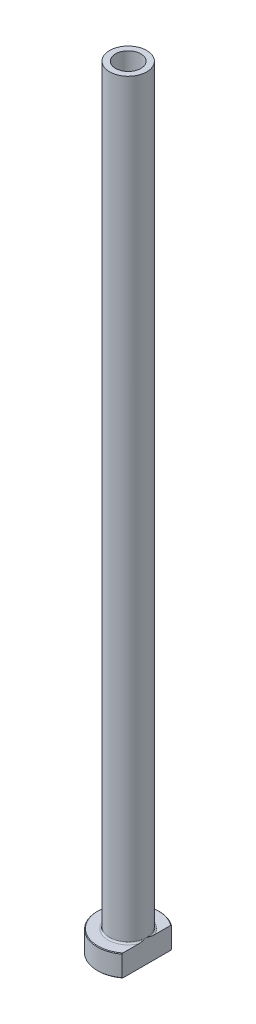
ISO-10303-21;
HEADER;
FILE_DESCRIPTION(('STEP AP214'),'2;1');
FILE_NAME('part.step','',(''),(''),'','','');
FILE_SCHEMA(('AUTOMOTIVE_DESIGN { 1 0 10303 214 1 1 1 1 }'));
ENDSEC;
DATA;
#1=APPLICATION_CONTEXT('core data for automotive mechanical design processes');
#2=APPLICATION_PROTOCOL_DEFINITION('international standard','automotive_design',2000,#1);
#3=PRODUCT_CONTEXT('',#1,'mechanical');
#4=PRODUCT('Part','Part','',(#3));
#5=PRODUCT_RELATED_PRODUCT_CATEGORY('part','',(#4));
#6=PRODUCT_DEFINITION_FORMATION('','',#4);
#7=PRODUCT_DEFINITION_CONTEXT('part definition',#1,'design');
#8=PRODUCT_DEFINITION('design','',#6,#7);
#9=PRODUCT_DEFINITION_SHAPE('','',#8);
#10=(LENGTH_UNIT() NAMED_UNIT(*) SI_UNIT(.MILLI.,.METRE.));
#11=(NAMED_UNIT(*) PLANE_ANGLE_UNIT() SI_UNIT($,.RADIAN.));
#12=(NAMED_UNIT(*) SI_UNIT($,.STERADIAN.) SOLID_ANGLE_UNIT());
#13=UNCERTAINTY_MEASURE_WITH_UNIT(LENGTH_MEASURE(1.E-05),#10,'distance_accuracy_value','');
#14=(GEOMETRIC_REPRESENTATION_CONTEXT(3) GLOBAL_UNCERTAINTY_ASSIGNED_CONTEXT((#13)) GLOBAL_UNIT_ASSIGNED_CONTEXT((#10,
#11,#12)) REPRESENTATION_CONTEXT('',''));
#15=CARTESIAN_POINT('',(0.,0.,0.));
#16=DIRECTION('',(0.,0.,1.));
#17=DIRECTION('',(1.,0.,0.));
#18=AXIS2_PLACEMENT_3D('',#15,#16,#17);
#19=CARTESIAN_POINT('',(0.,92.1876809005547,0.));
#20=DIRECTION('',(0.,1.,0.));
#21=DIRECTION('',(0.,0.,1.));
#22=AXIS2_PLACEMENT_3D('',#19,#20,#21);
#23=CYLINDRICAL_SURFACE('',#22,4.10000000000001);
#24=CARTESIAN_POINT('',(0.,250.,0.));
#25=DIRECTION('',(0.,1.,0.));
#26=DIRECTION('',(0.,0.,1.));
#27=AXIS2_PLACEMENT_3D('',#24,#25,#26);
#28=CIRCLE('',#27,4.10000000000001);
#29=CARTESIAN_POINT('',(0.,250.,4.10000000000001));
#30=VERTEX_POINT('',#29);
#31=EDGE_CURVE('E167',#30,#30,#28,.T.);
#32=ORIENTED_EDGE('',*,*,#31,.T.);
#33=EDGE_LOOP('',(#32));
#34=FACE_BOUND('',#33,.T.);
#35=CARTESIAN_POINT('',(0.,205.,0.));
#36=DIRECTION('',(0.,1.,0.));
#37=DIRECTION('',(0.,0.,1.));
#38=AXIS2_PLACEMENT_3D('',#35,#36,#37);
#39=CIRCLE('',#38,4.10000000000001);
#40=CARTESIAN_POINT('',(0.,205.,4.10000000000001));
#41=VERTEX_POINT('',#40);
#42=EDGE_CURVE('E170',#41,#41,#39,.T.);
#43=ORIENTED_EDGE('',*,*,#42,.F.);
#44=EDGE_LOOP('',(#43));
#45=FACE_BOUND('',#44,.T.);
#46=ADVANCED_FACE('F32',(#34,#45),#23,.F.);
#47=CARTESIAN_POINT('',(-4.10000000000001,250.,0.));
#48=DIRECTION('',(0.,1.,0.));
#49=DIRECTION('',(0.,0.,1.));
#50=AXIS2_PLACEMENT_3D('',#47,#48,#49);
#51=PLANE('',#50);
#52=CARTESIAN_POINT('',(0.,250.,0.));
#53=DIRECTION('',(0.,1.,0.));
#54=DIRECTION('',(0.,0.,1.));
#55=AXIS2_PLACEMENT_3D('',#52,#53,#54);
#56=CIRCLE('',#55,6.00000000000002);
#57=CARTESIAN_POINT('',(0.,250.,6.00000000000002));
#58=VERTEX_POINT('',#57);
#59=EDGE_CURVE('E174',#58,#58,#56,.T.);
#60=ORIENTED_EDGE('',*,*,#59,.T.);
#61=EDGE_LOOP('',(#60));
#62=FACE_BOUND('',#61,.T.);
#63=ORIENTED_EDGE('',*,*,#31,.F.);
#64=EDGE_LOOP('',(#63));
#65=FACE_BOUND('',#64,.T.);
#66=ADVANCED_FACE('F157',(#62,#65),#51,.T.);
#67=CARTESIAN_POINT('',(0.,92.1876809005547,0.));
#68=DIRECTION('',(0.,1.,0.));
#69=DIRECTION('',(0.,0.,1.));
#70=AXIS2_PLACEMENT_3D('',#67,#68,#69);
#71=CYLINDRICAL_SURFACE('',#70,6.);
#72=CARTESIAN_POINT('',(0.,7.50000000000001,0.));
#73=DIRECTION('',(0.,1.,0.));
#74=DIRECTION('',(0.,0.,1.));
#75=AXIS2_PLACEMENT_3D('',#72,#73,#74);
#76=CIRCLE('',#75,6.);
#77=CARTESIAN_POINT('',(6.,7.50000000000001,0.));
#78=VERTEX_POINT('',#77);
#79=EDGE_CURVE('E180',#78,#78,#76,.T.);
#80=ORIENTED_EDGE('',*,*,#79,.T.);
#81=EDGE_LOOP('',(#80));
#82=FACE_BOUND('',#81,.T.);
#83=ORIENTED_EDGE('',*,*,#59,.F.);
#84=EDGE_LOOP('',(#83));
#85=FACE_BOUND('',#84,.T.);
#86=ADVANCED_FACE('F162',(#82,#85),#71,.T.);
#87=CARTESIAN_POINT('',(-5.99999999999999,7.,0.));
#88=DIRECTION('',(0.,1.,0.));
#89=DIRECTION('',(0.,0.,1.));
#90=AXIS2_PLACEMENT_3D('',#87,#88,#89);
#91=PLANE('',#90);
#92=DIRECTION('',(0.,0.,1.));
#93=VECTOR('',#92,1.);
#94=CARTESIAN_POINT('',(6.,7.,0.));
#95=LINE('',#94,#93);
#96=CARTESIAN_POINT('',(6.,7.,-7.74854825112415));
#97=VERTEX_POINT('',#96);
#98=CARTESIAN_POINT('',(6.,7.,-2.50000000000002));
#99=VERTEX_POINT('',#98);
#100=EDGE_CURVE('E54',#97,#99,#95,.T.);
#101=ORIENTED_EDGE('',*,*,#100,.F.);
#102=CARTESIAN_POINT('',(0.,7.,0.));
#103=DIRECTION('',(0.,1.,0.));
#104=DIRECTION('',(0.,0.,1.));
#105=AXIS2_PLACEMENT_3D('',#102,#103,#104);
#106=CIRCLE('',#105,9.79999999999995);
#107=CARTESIAN_POINT('',(5.99999999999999,7.,7.74854825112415));
#108=VERTEX_POINT('',#107);
#109=EDGE_CURVE('E186',#97,#108,#106,.T.);
#110=ORIENTED_EDGE('',*,*,#109,.T.);
#111=CARTESIAN_POINT('',(6.,7.,2.50000000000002));
#112=VERTEX_POINT('',#111);
#113=EDGE_CURVE('E134',#112,#108,#95,.T.);
#114=ORIENTED_EDGE('',*,*,#113,.F.);
#115=CARTESIAN_POINT('',(0.,7.,0.));
#116=DIRECTION('',(0.,1.,0.));
#117=DIRECTION('',(0.,0.,1.));
#118=AXIS2_PLACEMENT_3D('',#115,#116,#117);
#119=CIRCLE('',#118,6.5);
#120=EDGE_CURVE('E183',#112,#99,#119,.F.);
#121=ORIENTED_EDGE('',*,*,#120,.T.);
#122=EDGE_LOOP('',(#101,#110,#114,#121));
#123=FACE_BOUND('',#122,.T.);
#124=ADVANCED_FACE('F197',(#123),#91,.T.);
#125=CARTESIAN_POINT('',(0.,92.1876809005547,0.));
#126=DIRECTION('',(0.,1.,0.));
#127=DIRECTION('',(0.,0.,1.));
#128=AXIS2_PLACEMENT_3D('',#125,#126,#127);
#129=CYLINDRICAL_SURFACE('',#128,9.99999999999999);
#130=DIRECTION('',(0.,-1.,0.));
#131=VECTOR('',#130,1.);
#132=CARTESIAN_POINT('',(5.99999999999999,250.,7.99999999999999));
#133=LINE('',#132,#131);
#134=CARTESIAN_POINT('',(5.99999999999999,6.8,7.99999999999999));
#135=VERTEX_POINT('',#134);
#136=CARTESIAN_POINT('',(5.99999999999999,0.200000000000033,7.99999999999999));
#137=VERTEX_POINT('',#136);
#138=EDGE_CURVE('E82',#135,#137,#133,.T.);
#139=ORIENTED_EDGE('',*,*,#138,.F.);
#140=CARTESIAN_POINT('',(0.,6.8,0.));
#141=DIRECTION('',(0.,1.,0.));
#142=DIRECTION('',(0.,0.,1.));
#143=AXIS2_PLACEMENT_3D('',#140,#141,#142);
#144=CIRCLE('',#143,9.99999999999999);
#145=CARTESIAN_POINT('',(6.,6.8,-7.99999999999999));
#146=VERTEX_POINT('',#145);
#147=EDGE_CURVE('E95',#135,#146,#144,.F.);
#148=ORIENTED_EDGE('',*,*,#147,.T.);
#149=DIRECTION('',(0.,-1.,0.));
#150=VECTOR('',#149,1.);
#151=CARTESIAN_POINT('',(6.,250.,-7.99999999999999));
#152=LINE('',#151,#150);
#153=CARTESIAN_POINT('',(6.,0.200000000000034,-7.99999999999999));
#154=VERTEX_POINT('',#153);
#155=EDGE_CURVE('E192',#146,#154,#152,.T.);
#156=ORIENTED_EDGE('',*,*,#155,.T.);
#157=CARTESIAN_POINT('',(0.,0.200000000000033,0.));
#158=DIRECTION('',(0.,-1.,0.));
#159=DIRECTION('',(0.,0.,-1.));
#160=AXIS2_PLACEMENT_3D('',#157,#158,#159);
#161=CIRCLE('',#160,9.99999999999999);
#162=EDGE_CURVE('E98',#154,#137,#161,.F.);
#163=ORIENTED_EDGE('',*,*,#162,.T.);
#164=EDGE_LOOP('',(#139,#148,#156,#163));
#165=FACE_BOUND('',#164,.T.);
#166=ADVANCED_FACE('F190',(#165),#129,.T.);
#167=CARTESIAN_POINT('',(-9.99999999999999,0.,0.));
#168=DIRECTION('',(0.,-1.,0.));
#169=DIRECTION('',(0.,0.,-1.));
#170=AXIS2_PLACEMENT_3D('',#167,#168,#169);
#171=PLANE('',#170);
#172=CARTESIAN_POINT('',(0.,0.,0.));
#173=DIRECTION('',(0.,-1.,0.));
#174=DIRECTION('',(0.,0.,-1.));
#175=AXIS2_PLACEMENT_3D('',#172,#173,#174);
#176=CIRCLE('',#175,4.84999999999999);
#177=CARTESIAN_POINT('',(0.,0.,-4.84999999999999));
#178=VERTEX_POINT('',#177);
#179=EDGE_CURVE('E40',#178,#178,#176,.F.);
#180=ORIENTED_EDGE('',*,*,#179,.T.);
#181=EDGE_LOOP('',(#180));
#182=FACE_BOUND('',#181,.T.);
#183=DIRECTION('',(0.,0.,-1.));
#184=VECTOR('',#183,1.);
#185=CARTESIAN_POINT('',(5.99999999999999,0.,7.99999999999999));
#186=LINE('',#185,#184);
#187=CARTESIAN_POINT('',(5.99999999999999,0.,7.74854825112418));
#188=VERTEX_POINT('',#187);
#189=CARTESIAN_POINT('',(6.,0.,-7.74854825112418));
#190=VERTEX_POINT('',#189);
#191=EDGE_CURVE('E47',#188,#190,#186,.T.);
#192=ORIENTED_EDGE('',*,*,#191,.F.);
#193=CARTESIAN_POINT('',(0.,0.,0.));
#194=DIRECTION('',(0.,-1.,0.));
#195=DIRECTION('',(0.,0.,-1.));
#196=AXIS2_PLACEMENT_3D('',#193,#194,#195);
#197=CIRCLE('',#196,9.79999999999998);
#198=EDGE_CURVE('E92',#188,#190,#197,.T.);
#199=ORIENTED_EDGE('',*,*,#198,.T.);
#200=EDGE_LOOP('',(#192,#199));
#201=FACE_BOUND('',#200,.T.);
#202=ADVANCED_FACE('F91',(#182,#201),#171,.T.);
#203=CARTESIAN_POINT('',(0.,92.1876809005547,0.));
#204=DIRECTION('',(0.,1.,0.));
#205=DIRECTION('',(0.,0.,1.));
#206=AXIS2_PLACEMENT_3D('',#203,#204,#205);
#207=CYLINDRICAL_SURFACE('',#206,4.35);
#208=CARTESIAN_POINT('',(0.,0.5,0.));
#209=DIRECTION('',(0.,-1.,0.));
#210=DIRECTION('',(0.,0.,-1.));
#211=AXIS2_PLACEMENT_3D('',#208,#209,#210);
#212=CIRCLE('',#211,4.35);
#213=CARTESIAN_POINT('',(0.,0.5,-4.35));
#214=VERTEX_POINT('',#213);
#215=EDGE_CURVE('E11',#214,#214,#212,.T.);
#216=ORIENTED_EDGE('',*,*,#215,.T.);
#217=EDGE_LOOP('',(#216));
#218=FACE_BOUND('',#217,.T.);
#219=CARTESIAN_POINT('',(0.,193.,0.));
#220=DIRECTION('',(0.,1.,0.));
#221=DIRECTION('',(0.,0.,1.));
#222=AXIS2_PLACEMENT_3D('',#219,#220,#221);
#223=CIRCLE('',#222,4.35000000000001);
#224=CARTESIAN_POINT('',(0.,193.,4.35000000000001));
#225=VERTEX_POINT('',#224);
#226=EDGE_CURVE('E172',#225,#225,#223,.T.);
#227=ORIENTED_EDGE('',*,*,#226,.T.);
#228=EDGE_LOOP('',(#227));
#229=FACE_BOUND('',#228,.T.);
#230=ADVANCED_FACE('F215',(#218,#229),#207,.F.);
#231=CARTESIAN_POINT('',(0.,193.,0.));
#232=DIRECTION('',(0.,-1.,0.));
#233=DIRECTION('',(0.,0.,-1.));
#234=AXIS2_PLACEMENT_3D('',#231,#232,#233);
#235=CONICAL_SURFACE('',#234,4.35000000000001,0.0208303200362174);
#236=ORIENTED_EDGE('',*,*,#42,.T.);
#237=EDGE_LOOP('',(#236));
#238=FACE_BOUND('',#237,.T.);
#239=ORIENTED_EDGE('',*,*,#226,.F.);
#240=EDGE_LOOP('',(#239));
#241=FACE_BOUND('',#240,.T.);
#242=ADVANCED_FACE('F111',(#238,#241),#235,.F.);
#243=CARTESIAN_POINT('',(0.,7.50000000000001,0.));
#244=DIRECTION('',(0.,1.,0.));
#245=DIRECTION('',(0.,0.,1.));
#246=AXIS2_PLACEMENT_3D('',#243,#244,#245);
#247=TOROIDAL_SURFACE('',#246,6.5,0.5);
#248=ORIENTED_EDGE('',*,*,#120,.F.);
#249=CARTESIAN_POINT('',(6.,7.50000000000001,0.));
#250=CARTESIAN_POINT('',(6.,7.50000080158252,6.70587372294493E-11));
#251=CARTESIAN_POINT('',(6.,7.50000160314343,2.62462786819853E-07));
#252=CARTESIAN_POINT('',(6.,7.5000031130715,1.01907214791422E-06));
#253=CARTESIAN_POINT('',(6.,7.5000038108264,1.52837961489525E-06));
#254=CARTESIAN_POINT('',(6.,7.50000523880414,2.7446766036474E-06));
#255=CARTESIAN_POINT('',(6.,7.50000595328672,3.47066780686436E-06));
#256=CARTESIAN_POINT('',(6.,7.5000072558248,4.99336247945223E-06));
#257=CARTESIAN_POINT('',(6.,7.500007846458,5.78800187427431E-06));
#258=CARTESIAN_POINT('',(6.,7.50000997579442,8.79661686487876E-06));
#259=CARTESIAN_POINT('',(6.,7.50001139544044,1.10980685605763E-05));
#260=CARTESIAN_POINT('',(6.,7.50001378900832,1.57116108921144E-05));
#261=CARTESIAN_POINT('',(6.,7.50001478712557,1.80117456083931E-05));
#262=CARTESIAN_POINT('',(6.,7.5000188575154,2.75423860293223E-05));
#263=CARTESIAN_POINT('',(6.,7.50002181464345,3.48285110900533E-05));
#264=CARTESIAN_POINT('',(6.,7.50002628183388,4.87408433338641E-05));
#265=CARTESIAN_POINT('',(6.,7.50002793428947,5.53214415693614E-05));
#266=CARTESIAN_POINT('',(5.99999999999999,7.50003978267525,0.000103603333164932));
#267=CARTESIAN_POINT('',(5.99999999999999,7.50004857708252,0.000145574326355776));
#268=CARTESIAN_POINT('',(6.,7.50008704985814,0.000310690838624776));
#269=CARTESIAN_POINT('',(6.,7.50012394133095,0.000432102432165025));
#270=CARTESIAN_POINT('',(5.99999999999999,7.50026686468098,0.00091116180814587));
#271=CARTESIAN_POINT('',(5.99999999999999,7.50036807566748,0.00126981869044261));
#272=CARTESIAN_POINT('',(6.,7.50077195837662,0.00268961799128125));
#273=CARTESIAN_POINT('',(6.,7.50108058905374,0.0037494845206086));
#274=CARTESIAN_POINT('',(5.99999999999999,7.50236320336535,0.00816658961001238));
#275=CARTESIAN_POINT('',(5.99999999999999,7.50332976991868,0.0115254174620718));
#276=CARTESIAN_POINT('',(6.00000000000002,7.51709821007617,0.0593544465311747));
#277=CARTESIAN_POINT('',(6.,7.52995465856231,0.103813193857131));
#278=CARTESIAN_POINT('',(5.99999999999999,7.55506029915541,0.190977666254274));
#279=CARTESIAN_POINT('',(5.99999999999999,7.56731321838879,0.233682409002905));
#280=CARTESIAN_POINT('',(6.,7.59325665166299,0.324512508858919));
#281=CARTESIAN_POINT('',(6.,7.60693346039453,0.372641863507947));
#282=CARTESIAN_POINT('',(6.,7.63422038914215,0.469489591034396));
#283=CARTESIAN_POINT('',(6.,7.64782813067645,0.518208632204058));
#284=CARTESIAN_POINT('',(6.,7.68043734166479,0.636338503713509));
#285=CARTESIAN_POINT('',(6.,7.69928754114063,0.705791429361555));
#286=CARTESIAN_POINT('',(6.,7.73566887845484,0.843102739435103));
#287=CARTESIAN_POINT('',(6.,7.75322160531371,0.910955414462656));
#288=CARTESIAN_POINT('',(6.,7.80024878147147,1.09857433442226));
#289=CARTESIAN_POINT('',(6.,7.82864900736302,1.21861610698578));
#290=CARTESIAN_POINT('',(6.,7.88105633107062,1.46081534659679));
#291=CARTESIAN_POINT('',(6.,7.90502088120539,1.58298212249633));
#292=CARTESIAN_POINT('',(6.,7.94810499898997,1.83866408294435));
#293=CARTESIAN_POINT('',(6.,7.96665856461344,1.9722808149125));
#294=CARTESIAN_POINT('',(6.,7.98621697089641,2.17329578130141));
#295=CARTESIAN_POINT('',(6.,7.991356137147,2.24029152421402));
#296=CARTESIAN_POINT('',(6.,7.99832928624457,2.37444824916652));
#297=CARTESIAN_POINT('',(6.,8.00016429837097,2.44160917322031));
#298=CARTESIAN_POINT('',(6.,7.99984674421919,2.56298631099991));
#299=CARTESIAN_POINT('',(6.,7.99839439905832,2.61720324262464));
#300=CARTESIAN_POINT('',(6.,7.99236557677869,2.72552036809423));
#301=CARTESIAN_POINT('',(6.,7.98778645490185,2.77962042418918));
#302=CARTESIAN_POINT('',(6.,7.97492915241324,2.88664710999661));
#303=CARTESIAN_POINT('',(6.,7.96670262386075,2.93957965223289));
#304=CARTESIAN_POINT('',(6.,7.94570253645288,3.04448333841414));
#305=CARTESIAN_POINT('',(6.,7.93293488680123,3.09645563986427));
#306=CARTESIAN_POINT('',(6.,7.90135968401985,3.19943606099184));
#307=CARTESIAN_POINT('',(6.,7.88247175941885,3.25042120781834));
#308=CARTESIAN_POINT('',(6.,7.84818685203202,3.32403783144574));
#309=CARTESIAN_POINT('',(6.,7.83579052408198,3.34806431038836));
#310=CARTESIAN_POINT('',(6.,7.80866016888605,3.39474488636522));
#311=CARTESIAN_POINT('',(6.,7.79392968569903,3.41740099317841));
#312=CARTESIAN_POINT('',(6.,7.76577135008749,3.45524173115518));
#313=CARTESIAN_POINT('',(6.,7.75294719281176,3.47087266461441));
#314=CARTESIAN_POINT('',(6.,7.72556313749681,3.50058040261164));
#315=CARTESIAN_POINT('',(6.,7.71100204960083,3.5146561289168));
#316=CARTESIAN_POINT('',(6.,7.67984897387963,3.54077006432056));
#317=CARTESIAN_POINT('',(6.,7.66323651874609,3.55278430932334));
#318=CARTESIAN_POINT('',(6.,7.62815222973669,3.57370259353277));
#319=CARTESIAN_POINT('',(6.,7.60968501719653,3.58261412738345));
#320=CARTESIAN_POINT('',(6.,7.57639898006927,3.5945465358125));
#321=CARTESIAN_POINT('',(6.,7.56191673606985,3.59850385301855));
#322=CARTESIAN_POINT('',(6.,7.53249228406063,3.603923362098));
#323=CARTESIAN_POINT('',(6.,7.51755044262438,3.60538749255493));
#324=CARTESIAN_POINT('',(6.,7.48761833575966,3.60568912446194));
#325=CARTESIAN_POINT('',(6.,7.47262803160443,3.60452285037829));
#326=CARTESIAN_POINT('',(6.,7.44306278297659,3.59966500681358));
#327=CARTESIAN_POINT('',(6.,7.42848812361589,3.59597174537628));
#328=CARTESIAN_POINT('',(6.,7.39702156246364,3.58531109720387));
#329=CARTESIAN_POINT('',(6.,7.38031267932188,3.57780732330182));
#330=CARTESIAN_POINT('',(6.,7.34834450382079,3.56018434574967));
#331=CARTESIAN_POINT('',(6.,7.33308764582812,3.55006085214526));
#332=CARTESIAN_POINT('',(6.,7.29715308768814,3.52252389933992));
#333=CARTESIAN_POINT('',(6.,7.27737832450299,3.50394102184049));
#334=CARTESIAN_POINT('',(6.,7.24088410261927,3.46399503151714));
#335=CARTESIAN_POINT('',(6.,7.22417302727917,3.44262455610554));
#336=CARTESIAN_POINT('',(6.,7.1814833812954,3.38088102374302));
#337=CARTESIAN_POINT('',(6.,7.15831783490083,3.33858120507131));
#338=CARTESIAN_POINT('',(6.,7.11822747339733,3.25128083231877));
#339=CARTESIAN_POINT('',(6.,7.10130560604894,3.20627901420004));
#340=CARTESIAN_POINT('',(6.,7.07193388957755,3.11375892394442));
#341=CARTESIAN_POINT('',(6.,7.05959256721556,3.06620687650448));
#342=CARTESIAN_POINT('',(6.,7.03888782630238,2.97022063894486));
#343=CARTESIAN_POINT('',(6.,7.0305289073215,2.92178551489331));
#344=CARTESIAN_POINT('',(6.,7.01697563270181,2.82374574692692));
#345=CARTESIAN_POINT('',(6.,7.01183067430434,2.77413446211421));
#346=CARTESIAN_POINT('',(6.,7.00435015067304,2.67475263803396));
#347=CARTESIAN_POINT('',(6.,7.00201229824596,2.62498226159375));
#348=CARTESIAN_POINT('',(6.,6.9989719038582,2.49377014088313));
#349=CARTESIAN_POINT('',(6.,7.00025005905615,2.41228296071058));
#350=CARTESIAN_POINT('',(6.,7.00775652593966,2.24952135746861));
#351=CARTESIAN_POINT('',(6.,7.01398784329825,2.16824709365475));
#352=CARTESIAN_POINT('',(6.,7.03045087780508,2.00575531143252));
#353=CARTESIAN_POINT('',(6.,7.04070001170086,1.92453960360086));
#354=CARTESIAN_POINT('',(6.,7.06442774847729,1.76257601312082));
#355=CARTESIAN_POINT('',(6.,7.07790697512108,1.68182822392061));
#356=CARTESIAN_POINT('',(6.,7.1197361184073,1.45394312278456));
#357=CARTESIAN_POINT('',(6.,7.15113840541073,1.30736987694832));
#358=CARTESIAN_POINT('',(6.,7.21927147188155,1.01717316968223));
#359=CARTESIAN_POINT('',(6.,7.25594155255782,0.873534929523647));
#360=CARTESIAN_POINT('',(6.,7.30765759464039,0.680321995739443));
#361=CARTESIAN_POINT('',(6.,7.32124979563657,0.630351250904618));
#362=CARTESIAN_POINT('',(6.,7.34913735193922,0.529103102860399));
#363=CARTESIAN_POINT('',(6.,7.36344174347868,0.47782818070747));
#364=CARTESIAN_POINT('',(6.,7.38809313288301,0.390268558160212));
#365=CARTESIAN_POINT('',(6.,7.39837954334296,0.353966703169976));
#366=CARTESIAN_POINT('',(6.,7.41893445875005,0.281778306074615));
#367=CARTESIAN_POINT('',(6.,7.42920197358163,0.245891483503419));
#368=CARTESIAN_POINT('',(5.99999999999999,7.44864004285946,0.178137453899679));
#369=CARTESIAN_POINT('',(5.99999999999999,7.4578051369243,0.146268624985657));
#370=CARTESIAN_POINT('',(6.,7.47656016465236,0.0812304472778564));
#371=CARTESIAN_POINT('',(6.00000000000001,7.48615204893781,0.0480615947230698));
#372=CARTESIAN_POINT('',(5.99999999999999,7.49666961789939,0.0115277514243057));
#373=CARTESIAN_POINT('',(5.99999999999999,7.49763547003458,0.00817123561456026));
#374=CARTESIAN_POINT('',(6.,7.49891791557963,0.00375466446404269));
#375=CARTESIAN_POINT('',(6.,7.49922706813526,0.00269301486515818));
#376=CARTESIAN_POINT('',(5.99999999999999,7.49963158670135,0.00127098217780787));
#377=CARTESIAN_POINT('',(5.99999999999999,7.49973292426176,0.00091187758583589));
#378=CARTESIAN_POINT('',(6.,7.49987600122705,0.000432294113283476));
#379=CARTESIAN_POINT('',(6.,7.49991291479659,0.000310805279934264));
#380=CARTESIAN_POINT('',(5.99999999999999,7.49995140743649,0.000145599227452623));
#381=CARTESIAN_POINT('',(5.99999999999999,7.49996020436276,0.000103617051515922));
#382=CARTESIAN_POINT('',(6.,7.49997205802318,5.53238234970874E-05));
#383=CARTESIAN_POINT('',(6.,7.499973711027,4.87425712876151E-05));
#384=CARTESIAN_POINT('',(6.,7.49997817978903,3.48289271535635E-05));
#385=CARTESIAN_POINT('',(6.,7.49998113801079,2.75421784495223E-05));
#386=CARTESIAN_POINT('',(6.,7.49998520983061,1.80109014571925E-05));
#387=CARTESIAN_POINT('',(6.,7.49998620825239,1.57107176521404E-05));
#388=CARTESIAN_POINT('',(6.,7.49998860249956,1.10971300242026E-05));
#389=CARTESIAN_POINT('',(6.,7.49999002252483,8.7956876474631E-06));
#390=CARTESIAN_POINT('',(6.,7.49999215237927,5.78714760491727E-06));
#391=CARTESIAN_POINT('',(6.,7.49999274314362,4.99254414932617E-06));
#392=CARTESIAN_POINT('',(6.,7.49999404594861,3.46994501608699E-06));
#393=CARTESIAN_POINT('',(6.,7.49999476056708,2.74401407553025E-06));
#394=CARTESIAN_POINT('',(6.,7.4999961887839,1.52786009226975E-06));
#395=CARTESIAN_POINT('',(6.,7.49999688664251,1.01863055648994E-06));
#396=CARTESIAN_POINT('',(6.,7.49999839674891,2.62215647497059E-07));
#397=CARTESIAN_POINT('',(6.,7.49999919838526,-6.70601327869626E-11));
#398=CARTESIAN_POINT('',(6.,7.50000000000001,0.));
#399=B_SPLINE_CURVE_WITH_KNOTS('',3,(#249,#250,#251,#252,#253,#254,#255,#256,#257,#258,#259,
#260,#261,#262,#263,#264,#265,#266,#267,#268,#269,#270,#271,#272,#273,#274,#275,#276,#277,#278,
#279,#280,#281,#282,#283,#284,#285,#286,#287,#288,#289,#290,#291,#292,#293,#294,#295,#296,#297,
#298,#299,#300,#301,#302,#303,#304,#305,#306,#307,#308,#309,#310,#311,#312,#313,#314,#315,#316,
#317,#318,#319,#320,#321,#322,#323,#324,#325,#326,#327,#328,#329,#330,#331,#332,#333,#334,#335,
#336,#337,#338,#339,#340,#341,#342,#343,#344,#345,#346,#347,#348,#349,#350,#351,#352,#353,#354,
#355,#356,#357,#358,#359,#360,#361,#362,#363,#364,#365,#366,#367,#368,#369,#370,#371,#372,#373,
#374,#375,#376,#377,#378,#379,#380,#381,#382,#383,#384,#385,#386,#387,#388,#389,#390,#391,#392,
#393,#394,#395,#396,#397,#398),.UNSPECIFIED.,.T.,.F.,(4,2,2,2,2,2,2,2,2,2,2,2,2,2,2,2,2,2,2,2,2,
2,2,2,2,2,2,2,2,2,2,2,2,2,2,2,2,2,2,2,2,2,2,2,2,2,2,2,2,2,2,2,2,2,2,2,2,2,2,2,2,2,2,2,2,2,2,2,2,
2,2,2,2,2,4),(0.,2.41532837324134E-06,5.00161759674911E-06,8.0411592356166E-06,
1.1009230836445E-05,1.90889735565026E-05,2.66047366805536E-05,5.01454073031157E-05,
7.04740016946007E-05,0.000199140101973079,0.000579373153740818,0.00169781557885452,
0.00500893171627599,0.0154949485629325,0.154330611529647,0.287615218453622,0.437719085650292,
0.589470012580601,0.8053618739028,1.01561737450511,1.38561400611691,1.75899405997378,
2.16331287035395,2.3648290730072,2.56628249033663,2.72891861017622,2.89169246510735,
3.0522314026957,3.21256219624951,3.37509011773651,3.4560997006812,3.53698744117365,
3.59753760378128,3.65812948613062,3.71938396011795,3.78048942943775,3.82533702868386,
3.87014974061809,3.91502681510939,3.95993396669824,4.01458097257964,4.06931803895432,
4.1502680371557,4.23143634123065,4.37530581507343,4.51924312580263,4.66640085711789,
4.81372446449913,4.96325999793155,5.11267360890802,5.35695170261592,5.60137814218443,
5.84687607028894,6.09242144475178,6.54191534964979,6.98659302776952,7.1419516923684,
7.30164895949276,7.41484221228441,7.52682205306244,7.62630458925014,7.72988447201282,
7.74036324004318,7.74367992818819,7.74479976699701,7.74518024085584,7.7453089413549,
7.74532927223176,7.74535281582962,7.74536033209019,7.74536841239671,7.74537138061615,
7.74537442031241,7.7453770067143,7.7453794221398),.UNSPECIFIED.);
#400=EDGE_CURVE('E126',#112,#78,#399,.T.);
#401=ORIENTED_EDGE('',*,*,#400,.T.);
#402=ORIENTED_EDGE('',*,*,#79,.F.);
#403=CARTESIAN_POINT('',(6.,7.50000000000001,0.));
#404=CARTESIAN_POINT('',(6.,7.4999991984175,-6.70570155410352E-11));
#405=CARTESIAN_POINT('',(6.,7.49999839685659,-2.62462784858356E-07));
#406=CARTESIAN_POINT('',(6.,7.49999688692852,-1.01907214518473E-06));
#407=CARTESIAN_POINT('',(6.,7.49999618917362,-1.5283796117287E-06));
#408=CARTESIAN_POINT('',(6.,7.49999476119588,-2.74467659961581E-06));
#409=CARTESIAN_POINT('',(6.,7.4999940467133,-3.47066780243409E-06));
#410=CARTESIAN_POINT('',(6.,7.49999274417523,-4.99336247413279E-06));
#411=CARTESIAN_POINT('',(6.,7.49999215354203,-5.78800186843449E-06));
#412=CARTESIAN_POINT('',(6.,7.49999002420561,-8.79661685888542E-06));
#413=CARTESIAN_POINT('',(6.,7.4999886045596,-1.10980685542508E-05));
#414=CARTESIAN_POINT('',(6.,7.49998621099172,-1.57116108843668E-05));
#415=CARTESIAN_POINT('',(6.,7.49998521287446,-1.80117455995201E-05));
#416=CARTESIAN_POINT('',(6.,7.49998114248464,-2.75423860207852E-05));
#417=CARTESIAN_POINT('',(6.,7.49997818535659,-3.48285110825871E-05));
#418=CARTESIAN_POINT('',(6.,7.49997371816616,-4.87408433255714E-05));
#419=CARTESIAN_POINT('',(6.,7.49997206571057,-5.53214415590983E-05));
#420=CARTESIAN_POINT('',(5.99999999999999,7.49996021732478,-0.000103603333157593));
#421=CARTESIAN_POINT('',(5.99999999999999,7.4999514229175,-0.00014557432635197));
#422=CARTESIAN_POINT('',(6.,7.49991295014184,-0.000310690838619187));
#423=CARTESIAN_POINT('',(6.,7.49987605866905,-0.000432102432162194));
#424=CARTESIAN_POINT('',(5.99999999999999,7.49973313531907,-0.000911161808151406));
#425=CARTESIAN_POINT('',(5.99999999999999,7.49963192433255,-0.00126981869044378));
#426=CARTESIAN_POINT('',(6.,7.49922804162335,-0.00268961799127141));
#427=CARTESIAN_POINT('',(6.,7.49891941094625,-0.00374948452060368));
#428=CARTESIAN_POINT('',(5.99999999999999,7.49763679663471,-0.00816658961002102));
#429=CARTESIAN_POINT('',(5.99999999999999,7.49667023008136,-0.0115254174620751));
#430=CARTESIAN_POINT('',(6.00000000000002,7.48290178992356,-0.0593544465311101));
#431=CARTESIAN_POINT('',(6.,7.47004534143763,-0.103813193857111));
#432=CARTESIAN_POINT('',(5.99999999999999,7.44493970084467,-0.190977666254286));
#433=CARTESIAN_POINT('',(5.99999999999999,7.43268678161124,-0.233682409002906));
#434=CARTESIAN_POINT('',(6.,7.40674334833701,-0.324512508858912));
#435=CARTESIAN_POINT('',(6.,7.39306653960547,-0.372641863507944));
#436=CARTESIAN_POINT('',(6.,7.36577961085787,-0.469489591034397));
#437=CARTESIAN_POINT('',(6.,7.35217186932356,-0.518208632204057));
#438=CARTESIAN_POINT('',(6.,7.31956265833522,-0.636338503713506));
#439=CARTESIAN_POINT('',(6.,7.30071245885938,-0.705791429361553));
#440=CARTESIAN_POINT('',(6.,7.26433112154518,-0.843102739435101));
#441=CARTESIAN_POINT('',(6.,7.24677839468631,-0.910955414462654));
#442=CARTESIAN_POINT('',(6.,7.19975121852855,-1.09857433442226));
#443=CARTESIAN_POINT('',(6.,7.17135099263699,-1.21861610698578));
#444=CARTESIAN_POINT('',(6.,7.11894366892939,-1.46081534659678));
#445=CARTESIAN_POINT('',(6.,7.09497911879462,-1.58298212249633));
#446=CARTESIAN_POINT('',(6.,7.05189500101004,-1.83866408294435));
#447=CARTESIAN_POINT('',(6.,7.03334143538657,-1.9722808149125));
#448=CARTESIAN_POINT('',(6.,7.0137830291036,-2.17329578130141));
#449=CARTESIAN_POINT('',(6.,7.00864386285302,-2.24029152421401));
#450=CARTESIAN_POINT('',(6.,7.00167071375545,-2.37444824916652));
#451=CARTESIAN_POINT('',(6.,6.99983570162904,-2.4416091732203));
#452=CARTESIAN_POINT('',(6.,7.00015325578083,-2.56298631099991));
#453=CARTESIAN_POINT('',(6.,7.00160560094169,-2.61720324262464));
#454=CARTESIAN_POINT('',(6.,7.00763442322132,-2.72552036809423));
#455=CARTESIAN_POINT('',(6.,7.01221354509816,-2.77962042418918));
#456=CARTESIAN_POINT('',(6.,7.02507084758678,-2.88664710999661));
#457=CARTESIAN_POINT('',(6.,7.03329737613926,-2.93957965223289));
#458=CARTESIAN_POINT('',(6.,7.05429746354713,-3.04448333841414));
#459=CARTESIAN_POINT('',(6.,7.06706511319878,-3.09645563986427));
#460=CARTESIAN_POINT('',(6.,7.09864031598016,-3.19943606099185));
#461=CARTESIAN_POINT('',(6.,7.11752824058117,-3.25042120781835));
#462=CARTESIAN_POINT('',(6.,7.15181314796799,-3.32403783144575));
#463=CARTESIAN_POINT('',(6.,7.16420947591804,-3.34806431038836));
#464=CARTESIAN_POINT('',(6.,7.19133983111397,-3.39474488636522));
#465=CARTESIAN_POINT('',(6.,7.20607031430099,-3.41740099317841));
#466=CARTESIAN_POINT('',(6.,7.23422864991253,-3.45524173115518));
#467=CARTESIAN_POINT('',(6.,7.24705280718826,-3.47087266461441));
#468=CARTESIAN_POINT('',(6.,7.2744368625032,-3.50058040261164));
#469=CARTESIAN_POINT('',(6.,7.28899795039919,-3.5146561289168));
#470=CARTESIAN_POINT('',(6.,7.32015102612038,-3.54077006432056));
#471=CARTESIAN_POINT('',(6.,7.33676348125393,-3.55278430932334));
#472=CARTESIAN_POINT('',(6.,7.37184777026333,-3.57370259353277));
#473=CARTESIAN_POINT('',(6.,7.39031498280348,-3.58261412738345));
#474=CARTESIAN_POINT('',(6.,7.42360101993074,-3.5945465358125));
#475=CARTESIAN_POINT('',(6.,7.43808326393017,-3.59850385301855));
#476=CARTESIAN_POINT('',(6.,7.46750771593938,-3.603923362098));
#477=CARTESIAN_POINT('',(6.,7.48244955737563,-3.60538749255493));
#478=CARTESIAN_POINT('',(6.,7.51238166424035,-3.60568912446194));
#479=CARTESIAN_POINT('',(6.,7.52737196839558,-3.60452285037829));
#480=CARTESIAN_POINT('',(6.,7.55693721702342,-3.59966500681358));
#481=CARTESIAN_POINT('',(6.,7.57151187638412,-3.59597174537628));
#482=CARTESIAN_POINT('',(6.,7.60297843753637,-3.58531109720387));
#483=CARTESIAN_POINT('',(6.,7.61968732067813,-3.57780732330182));
#484=CARTESIAN_POINT('',(6.,7.65165549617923,-3.56018434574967));
#485=CARTESIAN_POINT('',(6.,7.6669123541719,-3.55006085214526));
#486=CARTESIAN_POINT('',(6.,7.70284691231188,-3.52252389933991));
#487=CARTESIAN_POINT('',(6.,7.72262167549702,-3.50394102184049));
#488=CARTESIAN_POINT('',(6.,7.75911589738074,-3.46399503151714));
#489=CARTESIAN_POINT('',(6.,7.77582697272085,-3.44262455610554));
#490=CARTESIAN_POINT('',(6.,7.81851661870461,-3.38088102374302));
#491=CARTESIAN_POINT('',(6.,7.84168216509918,-3.33858120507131));
#492=CARTESIAN_POINT('',(6.,7.88177252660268,-3.25128083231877));
#493=CARTESIAN_POINT('',(6.,7.89869439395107,-3.20627901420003));
#494=CARTESIAN_POINT('',(6.,7.92806611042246,-3.11375892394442));
#495=CARTESIAN_POINT('',(6.,7.94040743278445,-3.06620687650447));
#496=CARTESIAN_POINT('',(6.,7.96111217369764,-2.97022063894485));
#497=CARTESIAN_POINT('',(6.,7.96947109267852,-2.9217855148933));
#498=CARTESIAN_POINT('',(6.,7.9830243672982,-2.82374574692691));
#499=CARTESIAN_POINT('',(6.,7.98816932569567,-2.77413446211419));
#500=CARTESIAN_POINT('',(6.,7.99564984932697,-2.67475263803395));
#501=CARTESIAN_POINT('',(6.,7.99798770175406,-2.62498226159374));
#502=CARTESIAN_POINT('',(6.,8.00102809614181,-2.49377014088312));
#503=CARTESIAN_POINT('',(6.,7.99974994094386,-2.41228296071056));
#504=CARTESIAN_POINT('',(6.,7.99224347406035,-2.24952135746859));
#505=CARTESIAN_POINT('',(6.,7.98601215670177,-2.16824709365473));
#506=CARTESIAN_POINT('',(6.,7.96954912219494,-2.0057553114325));
#507=CARTESIAN_POINT('',(6.,7.95929998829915,-1.92453960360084));
#508=CARTESIAN_POINT('',(6.,7.93557225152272,-1.7625760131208));
#509=CARTESIAN_POINT('',(6.,7.92209302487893,-1.68182822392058));
#510=CARTESIAN_POINT('',(6.,7.88026388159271,-1.45394312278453));
#511=CARTESIAN_POINT('',(6.,7.84886159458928,-1.30736987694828));
#512=CARTESIAN_POINT('',(6.,7.78072852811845,-1.01717316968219));
#513=CARTESIAN_POINT('',(6.,7.74405844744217,-0.873534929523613));
#514=CARTESIAN_POINT('',(6.,7.69234240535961,-0.680321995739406));
#515=CARTESIAN_POINT('',(6.,7.67875020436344,-0.630351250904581));
#516=CARTESIAN_POINT('',(6.,7.65086264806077,-0.529103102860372));
#517=CARTESIAN_POINT('',(6.,7.6365582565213,-0.477828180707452));
#518=CARTESIAN_POINT('',(6.,7.61190686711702,-0.390268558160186));
#519=CARTESIAN_POINT('',(6.,7.60162045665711,-0.35396670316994));
#520=CARTESIAN_POINT('',(6.,7.58106554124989,-0.28177830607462));
#521=CARTESIAN_POINT('',(6.,7.57079802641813,-0.245891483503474));
#522=CARTESIAN_POINT('',(5.99999999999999,7.55135995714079,-0.178137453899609));
#523=CARTESIAN_POINT('',(5.99999999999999,7.54219486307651,-0.146268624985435));
#524=CARTESIAN_POINT('',(6.,7.52343983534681,-0.0812304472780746));
#525=CARTESIAN_POINT('',(6.00000000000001,7.51384795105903,-0.0480615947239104));
#526=CARTESIAN_POINT('',(5.99999999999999,7.50333038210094,-0.0115277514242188));
#527=CARTESIAN_POINT('',(5.99999999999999,7.50236452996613,-0.00817123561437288));
#528=CARTESIAN_POINT('',(6.,7.50108208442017,-0.00375466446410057));
#529=CARTESIAN_POINT('',(6.,7.50077293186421,-0.00269301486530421));
#530=CARTESIAN_POINT('',(5.99999999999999,7.50036841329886,-0.00127098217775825));
#531=CARTESIAN_POINT('',(5.99999999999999,7.50026707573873,-0.000911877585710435));
#532=CARTESIAN_POINT('',(6.,7.50012399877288,-0.000432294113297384));
#533=CARTESIAN_POINT('',(6.,7.50008708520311,-0.000310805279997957));
#534=CARTESIAN_POINT('',(5.99999999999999,7.50004859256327,-0.000145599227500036));
#535=CARTESIAN_POINT('',(5.99999999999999,7.50003979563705,-0.000103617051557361));
#536=CARTESIAN_POINT('',(6.,7.50002794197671,-5.53238235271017E-05));
#537=CARTESIAN_POINT('',(6.,7.5000262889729,-4.87425713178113E-05));
#538=CARTESIAN_POINT('',(6.,7.50002182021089,-3.48289271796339E-05));
#539=CARTESIAN_POINT('',(6.,7.50001886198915,-2.7542178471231E-05));
#540=CARTESIAN_POINT('',(6.,7.50001479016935,-1.80109014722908E-05));
#541=CARTESIAN_POINT('',(6.,7.50001379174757,-1.57107176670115E-05));
#542=CARTESIAN_POINT('',(6.,7.50001139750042,-1.1097130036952E-05));
#543=CARTESIAN_POINT('',(6.,7.50000997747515,-8.79568765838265E-06));
#544=CARTESIAN_POINT('',(6.,7.50000784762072,-5.78714761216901E-06));
#545=CARTESIAN_POINT('',(6.,7.50000725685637,-4.99254415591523E-06));
#546=CARTESIAN_POINT('',(6.,7.50000595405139,-3.46994502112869E-06));
#547=CARTESIAN_POINT('',(6.,7.50000523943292,-2.74401407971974E-06));
#548=CARTESIAN_POINT('',(6.,7.50000381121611,-1.52786009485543E-06));
#549=CARTESIAN_POINT('',(6.,7.5000031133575,-1.01863055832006E-06));
#550=CARTESIAN_POINT('',(6.,7.5000016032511,-2.622156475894E-07));
#551=CARTESIAN_POINT('',(6.,7.50000080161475,6.70610132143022E-11));
#552=CARTESIAN_POINT('',(6.,7.50000000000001,0.));
#553=B_SPLINE_CURVE_WITH_KNOTS('',3,(#403,#404,#405,#406,#407,#408,#409,#410,#411,#412,#413,
#414,#415,#416,#417,#418,#419,#420,#421,#422,#423,#424,#425,#426,#427,#428,#429,#430,#431,#432,
#433,#434,#435,#436,#437,#438,#439,#440,#441,#442,#443,#444,#445,#446,#447,#448,#449,#450,#451,
#452,#453,#454,#455,#456,#457,#458,#459,#460,#461,#462,#463,#464,#465,#466,#467,#468,#469,#470,
#471,#472,#473,#474,#475,#476,#477,#478,#479,#480,#481,#482,#483,#484,#485,#486,#487,#488,#489,
#490,#491,#492,#493,#494,#495,#496,#497,#498,#499,#500,#501,#502,#503,#504,#505,#506,#507,#508,
#509,#510,#511,#512,#513,#514,#515,#516,#517,#518,#519,#520,#521,#522,#523,#524,#525,#526,#527,
#528,#529,#530,#531,#532,#533,#534,#535,#536,#537,#538,#539,#540,#541,#542,#543,#544,#545,#546,
#547,#548,#549,#550,#551,#552),.UNSPECIFIED.,.T.,.F.,(4,2,2,2,2,2,2,2,2,2,2,2,2,2,2,2,2,2,2,2,2,
2,2,2,2,2,2,2,2,2,2,2,2,2,2,2,2,2,2,2,2,2,2,2,2,2,2,2,2,2,2,2,2,2,2,2,2,2,2,2,2,2,2,2,2,2,2,2,2,
2,2,2,2,2,4),(0.,2.41532836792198E-06,5.00161758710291E-06,8.04115922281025E-06,
1.1009230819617E-05,1.90889735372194E-05,2.66047366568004E-05,5.01454072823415E-05,
7.04740016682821E-05,0.000199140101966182,0.000579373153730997,0.00169781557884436,
0.00500893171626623,0.0154949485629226,0.154330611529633,0.287615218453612,0.437719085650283,
0.589470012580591,0.805361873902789,1.0156173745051,1.3856140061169,1.75899405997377,
2.16331287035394,2.36482907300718,2.56628249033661,2.72891861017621,2.89169246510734,
3.05223140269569,3.2125621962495,3.3750901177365,3.45609970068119,3.53698744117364,
3.59753760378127,3.65812948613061,3.71938396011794,3.78048942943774,3.82533702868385,
3.87014974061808,3.91502681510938,3.95993396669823,4.01458097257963,4.06931803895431,
4.15026803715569,4.23143634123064,4.37530581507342,4.51924312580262,4.66640085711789,
4.81372446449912,4.96325999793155,5.11267360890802,5.35695170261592,5.60137814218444,
5.84687607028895,6.09242144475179,6.54191534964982,6.98659302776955,7.14195169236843,
7.30164895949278,7.41484221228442,7.52682205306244,7.62630458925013,7.72988447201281,
7.74036324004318,7.74367992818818,7.744799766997,7.74518024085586,7.7453089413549,
7.74532927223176,7.74535281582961,7.74536033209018,7.74536841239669,7.74537138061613,
7.74537442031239,7.74537700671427,7.74537942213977),.UNSPECIFIED.);
#554=EDGE_CURVE('E135',#78,#99,#553,.T.);
#555=ORIENTED_EDGE('',*,*,#554,.T.);
#556=EDGE_LOOP('',(#248,#401,#402,#555));
#557=FACE_BOUND('',#556,.T.);
#558=ADVANCED_FACE('F141',(#557),#247,.F.);
#559=CARTESIAN_POINT('',(0.,7.00000000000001,0.));
#560=DIRECTION('',(0.,-1.,0.));
#561=DIRECTION('',(0.,0.,-1.));
#562=AXIS2_PLACEMENT_3D('',#559,#560,#561);
#563=CONICAL_SURFACE('',#562,9.79999999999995,0.785398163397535);
#564=CARTESIAN_POINT('',(6.,-1.79552203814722,-17.6009499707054));
#565=CARTESIAN_POINT('',(6.,-1.52401937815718,-17.3141017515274));
#566=CARTESIAN_POINT('',(6.,-1.25287676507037,-17.0269132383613));
#567=CARTESIAN_POINT('',(6.,-0.711434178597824,-16.4517398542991));
#568=CARTESIAN_POINT('',(6.,-0.441134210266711,-16.1637549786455));
#569=CARTESIAN_POINT('',(6.,0.368940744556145,-15.2977662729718));
#570=CARTESIAN_POINT('',(6.,0.907258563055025,-14.7183951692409));
#571=CARTESIAN_POINT('',(6.,1.72215780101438,-13.8331216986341));
#572=CARTESIAN_POINT('',(6.,2.00071138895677,-13.5290344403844));
#573=CARTESIAN_POINT('',(6.,2.55603074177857,-12.9192325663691));
#574=CARTESIAN_POINT('',(6.,2.83279651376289,-12.6135179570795));
#575=CARTESIAN_POINT('',(6.,3.38385174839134,-12.000460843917));
#576=CARTESIAN_POINT('',(6.,3.65814356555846,-11.6931204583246));
#577=CARTESIAN_POINT('',(6.,4.20403297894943,-11.0760595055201));
#578=CARTESIAN_POINT('',(6.,4.47563060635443,-10.7663389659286));
#579=CARTESIAN_POINT('',(6.,5.01505245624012,-10.1444038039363));
#580=CARTESIAN_POINT('',(6.,5.2828815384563,-9.83219340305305));
#581=CARTESIAN_POINT('',(6.,5.81422935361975,-9.20408822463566));
#582=CARTESIAN_POINT('',(6.,6.07774785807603,-8.8881932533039));
#583=CARTESIAN_POINT('',(6.,6.60003626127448,-8.25062578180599));
#584=CARTESIAN_POINT('',(6.,6.85878611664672,-7.92893682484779));
#585=CARTESIAN_POINT('',(6.,7.3685950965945,-7.27955943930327));
#586=CARTESIAN_POINT('',(6.,7.61965542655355,-6.95187196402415));
#587=CARTESIAN_POINT('',(6.,7.98576066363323,-6.45775713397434));
#588=CARTESIAN_POINT('',(6.,8.10486172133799,-6.29433436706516));
#589=CARTESIAN_POINT('',(6.,8.34000134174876,-5.96530360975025));
#590=CARTESIAN_POINT('',(6.,8.45604001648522,-5.79969569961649));
#591=CARTESIAN_POINT('',(6.,8.68455547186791,-5.46582678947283));
#592=CARTESIAN_POINT('',(6.,8.79702913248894,-5.29756364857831));
#593=CARTESIAN_POINT('',(6.,9.01753757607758,-4.9581617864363));
#594=CARTESIAN_POINT('',(6.,9.12557269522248,-4.78702328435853));
#595=CARTESIAN_POINT('',(6.,9.33560820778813,-4.44248614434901));
#596=CARTESIAN_POINT('',(6.,9.43764111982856,-4.26910741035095));
#597=CARTESIAN_POINT('',(6.,9.6351809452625,-3.91862113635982));
#598=CARTESIAN_POINT('',(6.,9.73068703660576,-3.74151313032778));
#599=CARTESIAN_POINT('',(6.,9.9134878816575,-3.38344678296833));
#600=CARTESIAN_POINT('',(6.,10.0007956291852,-3.20249511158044));
#601=CARTESIAN_POINT('',(6.,10.1654678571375,-2.83615347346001));
#602=CARTESIAN_POINT('',(6.,10.2428364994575,-2.6507654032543));
#603=CARTESIAN_POINT('',(6.,10.3476493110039,-2.37476230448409));
#604=CARTESIAN_POINT('',(6.,10.3798377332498,-2.28593872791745));
#605=CARTESIAN_POINT('',(6.,10.4412613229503,-2.10727300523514));
#606=CARTESIAN_POINT('',(6.,10.4704963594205,-2.0174308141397));
#607=CARTESIAN_POINT('',(6.,10.5533861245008,-1.74635894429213));
#608=CARTESIAN_POINT('',(6.,10.6022144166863,-1.56361273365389));
#609=CARTESIAN_POINT('',(6.,10.6846214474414,-1.19573724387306));
#610=CARTESIAN_POINT('',(6.,10.7182826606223,-1.01062662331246));
#611=CARTESIAN_POINT('',(6.,10.768981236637,-0.638123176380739));
#612=CARTESIAN_POINT('',(6.,10.7860205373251,-0.450730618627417));
#613=CARTESIAN_POINT('',(6.,10.8025183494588,-0.0738640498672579));
#614=CARTESIAN_POINT('',(6.,10.801854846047,0.115615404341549));
#615=CARTESIAN_POINT('',(6.,10.7826880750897,0.493653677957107));
#616=CARTESIAN_POINT('',(6.,10.7641846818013,0.682212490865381));
#617=CARTESIAN_POINT('',(6.,10.710325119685,1.05776266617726));
#618=CARTESIAN_POINT('',(6.,10.6748911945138,1.24474270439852));
#619=CARTESIAN_POINT('',(6.,10.5890121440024,1.61520150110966));
#620=CARTESIAN_POINT('',(6.,10.5385638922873,1.79867952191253));
#621=CARTESIAN_POINT('',(6.,10.3911282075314,2.26914112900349));
#622=CARTESIAN_POINT('',(6.,10.284278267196,2.55302531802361));
#623=CARTESIAN_POINT('',(6.,10.0463958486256,3.11045503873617));
#624=CARTESIAN_POINT('',(6.,9.91534345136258,3.38399182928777));
#625=CARTESIAN_POINT('',(6.,9.70492342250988,3.78859721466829));
#626=CARTESIAN_POINT('',(5.99999999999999,9.6320985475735,3.92313856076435));
#627=CARTESIAN_POINT('',(5.99999999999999,9.48259417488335,4.19006838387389));
#628=CARTESIAN_POINT('',(5.99999999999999,9.40591462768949,4.32245683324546));
#629=CARTESIAN_POINT('',(5.99999999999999,9.24930540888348,4.585205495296));
#630=CARTESIAN_POINT('',(5.99999999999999,9.1693772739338,4.71556662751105));
#631=CARTESIAN_POINT('',(5.99999999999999,9.00669783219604,4.97450350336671));
#632=CARTESIAN_POINT('',(5.99999999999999,8.92394663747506,5.10307931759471));
#633=CARTESIAN_POINT('',(5.99999999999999,8.64351229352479,5.52985219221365));
#634=CARTESIAN_POINT('',(5.99999999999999,8.44039926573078,5.82448590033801));
#635=CARTESIAN_POINT('',(5.99999999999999,8.02460715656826,6.40694921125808));
#636=CARTESIAN_POINT('',(5.99999999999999,7.81192597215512,6.69477729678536));
#637=CARTESIAN_POINT('',(5.99999999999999,7.37931497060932,7.26525171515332));
#638=CARTESIAN_POINT('',(5.99999999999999,7.15937990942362,7.54789405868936));
#639=CARTESIAN_POINT('',(5.99999999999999,6.71413940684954,8.10886295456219));
#640=CARTESIAN_POINT('',(5.99999999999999,6.4888344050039,8.38718985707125));
#641=CARTESIAN_POINT('',(5.99999999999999,6.03331036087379,8.94128328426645));
#642=CARTESIAN_POINT('',(5.99999999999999,5.80307787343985,9.2170387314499));
#643=CARTESIAN_POINT('',(5.99999999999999,5.33927970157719,9.76573512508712));
#644=CARTESIAN_POINT('',(5.99999999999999,5.1057139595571,10.0386760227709));
#645=CARTESIAN_POINT('',(5.99999999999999,4.63600560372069,10.5821276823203));
#646=CARTESIAN_POINT('',(5.99999999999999,4.39986411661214,10.8526394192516));
#647=CARTESIAN_POINT('',(5.99999999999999,3.92539621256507,11.3917411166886));
#648=CARTESIAN_POINT('',(5.99999999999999,3.68706977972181,11.6603310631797));
#649=CARTESIAN_POINT('',(5.99999999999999,3.01761185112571,12.409723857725));
#650=CARTESIAN_POINT('',(5.99999999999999,2.58447471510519,12.888734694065));
#651=CARTESIAN_POINT('',(5.99999999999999,1.71393239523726,13.8429570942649));
#652=CARTESIAN_POINT('',(5.99999999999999,1.27652670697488,14.3181681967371));
#653=CARTESIAN_POINT('',(5.99999999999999,0.401335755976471,15.2626172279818));
#654=CARTESIAN_POINT('',(5.99999999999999,-0.0364292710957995,15.7318739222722));
#655=CARTESIAN_POINT('',(5.99999999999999,-0.694863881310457,16.434014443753));
#656=CARTESIAN_POINT('',(5.99999999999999,-0.914623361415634,16.6677530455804));
#657=CARTESIAN_POINT('',(5.99999999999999,-1.35468319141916,17.1347195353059));
#658=CARTESIAN_POINT('',(5.99999999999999,-1.57498354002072,17.3679474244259));
#659=CARTESIAN_POINT('',(5.99999999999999,-1.79552203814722,17.6009499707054));
#660=B_SPLINE_CURVE_WITH_KNOTS('',3,(#564,#565,#566,#567,#568,#569,#570,#571,#572,#573,#574,
#575,#576,#577,#578,#579,#580,#581,#582,#583,#584,#585,#586,#587,#588,#589,#590,#591,#592,#593,
#594,#595,#596,#597,#598,#599,#600,#601,#602,#603,#604,#605,#606,#607,#608,#609,#610,#611,#612,
#613,#614,#615,#616,#617,#618,#619,#620,#621,#622,#623,#624,#625,#626,#627,#628,#629,#630,#631,
#632,#633,#634,#635,#636,#637,#638,#639,#640,#641,#642,#643,#644,#645,#646,#647,#648,#649,#650,
#651,#652,#653,#654,#655,#656,#657,#658,#659),.UNSPECIFIED.,.F.,.F.,(4,2,2,2,2,2,2,2,2,2,2,2,2,
2,2,2,2,2,2,2,2,2,2,2,2,2,2,2,2,2,2,2,2,2,2,2,2,2,2,2,2,2,2,2,2,2,2,4),(0.,1.18488703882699,
2.36978117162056,4.74232601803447,5.97947486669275,7.21661879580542,8.45242468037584,
9.68821624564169,10.9222327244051,12.1563144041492,13.3947518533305,14.6329941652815,
15.2396202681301,15.8462241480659,16.4533450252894,17.0604198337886,17.6638266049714,
18.2673092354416,18.8698186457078,19.4720749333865,19.7554574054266,20.0388524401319,
20.6057348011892,21.1694962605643,21.7331919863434,22.3007739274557,22.8683598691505,
23.4385779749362,24.0089148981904,24.9172532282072,25.8263424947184,26.2852509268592,
26.7441652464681,27.2028649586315,27.6615464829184,28.7348221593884,29.8083349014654,
30.8826415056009,31.9568604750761,33.0345254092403,34.1122089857,35.1894386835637,
36.2666762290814,38.2040405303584,40.1416366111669,42.0668676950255,43.0293387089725,
43.9918074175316),.UNSPECIFIED.);
#661=EDGE_CURVE('E133',#146,#97,#660,.T.);
#662=ORIENTED_EDGE('',*,*,#661,.F.);
#663=ORIENTED_EDGE('',*,*,#147,.F.);
#664=EDGE_CURVE('E118',#108,#135,#660,.T.);
#665=ORIENTED_EDGE('',*,*,#664,.F.);
#666=ORIENTED_EDGE('',*,*,#109,.F.);
#667=EDGE_LOOP('',(#662,#663,#665,#666));
#668=FACE_BOUND('',#667,.T.);
#669=ADVANCED_FACE('F145',(#668),#563,.T.);
#670=CARTESIAN_POINT('',(0.,0.200000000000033,0.));
#671=DIRECTION('',(0.,1.,0.));
#672=DIRECTION('',(0.,0.,1.));
#673=AXIS2_PLACEMENT_3D('',#670,#671,#672);
#674=CONICAL_SURFACE('',#673,9.99999999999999,0.785398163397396);
#675=CARTESIAN_POINT('',(5.99999999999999,8.79552203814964,17.6009499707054));
#676=CARTESIAN_POINT('',(5.99999999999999,8.52401937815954,17.3141017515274));
#677=CARTESIAN_POINT('',(5.99999999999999,8.25287676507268,17.0269132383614));
#678=CARTESIAN_POINT('',(5.99999999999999,7.71143417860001,16.4517398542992));
#679=CARTESIAN_POINT('',(5.99999999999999,7.44113421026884,16.1637549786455));
#680=CARTESIAN_POINT('',(5.99999999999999,6.6310592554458,15.297766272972));
#681=CARTESIAN_POINT('',(5.99999999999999,6.0927414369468,14.7183951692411));
#682=CARTESIAN_POINT('',(5.99999999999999,5.27784219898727,13.8331216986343));
#683=CARTESIAN_POINT('',(5.99999999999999,4.99928861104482,13.5290344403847));
#684=CARTESIAN_POINT('',(5.99999999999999,4.44396925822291,12.9192325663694));
#685=CARTESIAN_POINT('',(5.99999999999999,4.16720348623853,12.6135179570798));
#686=CARTESIAN_POINT('',(5.99999999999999,3.61614825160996,12.0004608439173));
#687=CARTESIAN_POINT('',(5.99999999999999,3.34185643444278,11.6931204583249));
#688=CARTESIAN_POINT('',(5.99999999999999,2.7959670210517,11.0760595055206));
#689=CARTESIAN_POINT('',(5.99999999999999,2.52436939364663,10.766338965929));
#690=CARTESIAN_POINT('',(5.99999999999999,1.98494754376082,10.1444038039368));
#691=CARTESIAN_POINT('',(5.99999999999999,1.71711846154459,9.83219340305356));
#692=CARTESIAN_POINT('',(5.99999999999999,1.18577064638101,9.20408822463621));
#693=CARTESIAN_POINT('',(5.99999999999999,0.922252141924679,8.88819325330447));
#694=CARTESIAN_POINT('',(5.99999999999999,0.399963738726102,8.2506257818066));
#695=CARTESIAN_POINT('',(5.99999999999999,0.141213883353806,7.92893682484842));
#696=CARTESIAN_POINT('',(5.99999999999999,-0.368595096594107,7.27955943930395));
#697=CARTESIAN_POINT('',(5.99999999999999,-0.61965542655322,6.95187196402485));
#698=CARTESIAN_POINT('',(5.99999999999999,-0.985760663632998,6.45775713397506));
#699=CARTESIAN_POINT('',(5.99999999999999,-1.10486172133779,6.29433436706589));
#700=CARTESIAN_POINT('',(5.99999999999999,-1.34000134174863,5.965303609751));
#701=CARTESIAN_POINT('',(5.99999999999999,-1.45604001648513,5.79969569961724));
#702=CARTESIAN_POINT('',(5.99999999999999,-1.68455547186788,5.4658267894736));
#703=CARTESIAN_POINT('',(5.99999999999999,-1.79702913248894,5.29756364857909));
#704=CARTESIAN_POINT('',(5.99999999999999,-2.01753757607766,4.95816178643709));
#705=CARTESIAN_POINT('',(5.99999999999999,-2.1255726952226,4.78702328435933));
#706=CARTESIAN_POINT('',(5.99999999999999,-2.33560820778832,4.44248614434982));
#707=CARTESIAN_POINT('',(5.99999999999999,-2.43764111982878,4.26910741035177));
#708=CARTESIAN_POINT('',(5.99999999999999,-2.63518094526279,3.91862113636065));
#709=CARTESIAN_POINT('',(6.,-2.7306870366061,3.74151313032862));
#710=CARTESIAN_POINT('',(6.,-2.91348788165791,3.38344678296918));
#711=CARTESIAN_POINT('',(6.,-3.00079562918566,3.20249511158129));
#712=CARTESIAN_POINT('',(6.,-3.16546785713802,2.83615347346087));
#713=CARTESIAN_POINT('',(6.,-3.24283649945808,2.65076540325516));
#714=CARTESIAN_POINT('',(6.,-3.34764931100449,2.37476230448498));
#715=CARTESIAN_POINT('',(6.,-3.37983773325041,2.28593872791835));
#716=CARTESIAN_POINT('',(6.,-3.44126132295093,2.10727300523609));
#717=CARTESIAN_POINT('',(6.,-3.47049635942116,2.01743081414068));
#718=CARTESIAN_POINT('',(6.,-3.55338612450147,1.74635894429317));
#719=CARTESIAN_POINT('',(6.,-3.60221441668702,1.56361273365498));
#720=CARTESIAN_POINT('',(6.,-3.68462144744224,1.19573724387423));
#721=CARTESIAN_POINT('',(6.,-3.71828266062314,1.01062662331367));
#722=CARTESIAN_POINT('',(6.,-3.76898123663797,0.638123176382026));
#723=CARTESIAN_POINT('',(6.,-3.78602053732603,0.450730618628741));
#724=CARTESIAN_POINT('',(6.,-3.8025183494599,0.0738640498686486));
#725=CARTESIAN_POINT('',(6.,-3.80185484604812,-0.11561540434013));
#726=CARTESIAN_POINT('',(6.,-3.78268807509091,-0.493653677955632));
#727=CARTESIAN_POINT('',(6.,-3.76418468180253,-0.682212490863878));
#728=CARTESIAN_POINT('',(6.,-3.71032511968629,-1.0577626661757));
#729=CARTESIAN_POINT('',(6.,-3.67489119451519,-1.24474270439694));
#730=CARTESIAN_POINT('',(6.,-3.58901214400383,-1.61520150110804));
#731=CARTESIAN_POINT('',(6.,-3.53856389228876,-1.79867952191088));
#732=CARTESIAN_POINT('',(6.,-3.39112820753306,-2.2691411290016));
#733=CARTESIAN_POINT('',(6.,-3.28427826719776,-2.55302531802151));
#734=CARTESIAN_POINT('',(6.,-3.04639584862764,-3.11045503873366));
#735=CARTESIAN_POINT('',(5.99999999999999,-2.91534345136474,-3.38399182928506));
#736=CARTESIAN_POINT('',(6.,-2.70492342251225,-3.78859721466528));
#737=CARTESIAN_POINT('',(6.,-2.63209854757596,-3.92313856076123));
#738=CARTESIAN_POINT('',(6.,-2.48259417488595,-4.19006838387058));
#739=CARTESIAN_POINT('',(6.,-2.40591462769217,-4.32245683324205));
#740=CARTESIAN_POINT('',(6.,-2.24930540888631,-4.58520549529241));
#741=CARTESIAN_POINT('',(6.,-2.1693772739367,-4.71556662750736));
#742=CARTESIAN_POINT('',(6.,-2.0066978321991,-4.97450350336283));
#743=CARTESIAN_POINT('',(6.,-1.9239466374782,-5.10307931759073));
#744=CARTESIAN_POINT('',(6.,-1.64351229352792,-5.52985219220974));
#745=CARTESIAN_POINT('',(6.,-1.44039926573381,-5.82448590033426));
#746=CARTESIAN_POINT('',(6.,-1.02460715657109,-6.40694921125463));
#747=CARTESIAN_POINT('',(6.,-0.811925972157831,-6.69477729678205));
#748=CARTESIAN_POINT('',(6.,-0.37931497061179,-7.26525171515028));
#749=CARTESIAN_POINT('',(6.,-0.159379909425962,-7.54789405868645));
#750=CARTESIAN_POINT('',(6.,0.285860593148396,-8.10886295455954));
#751=CARTESIAN_POINT('',(6.,0.511165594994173,-8.38718985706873));
#752=CARTESIAN_POINT('',(6.,0.966689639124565,-8.94128328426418));
#753=CARTESIAN_POINT('',(6.,1.19692212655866,-9.21703873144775));
#754=CARTESIAN_POINT('',(6.,1.66072029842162,-9.76573512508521));
#755=CARTESIAN_POINT('',(6.,1.89428604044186,-10.0386760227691));
#756=CARTESIAN_POINT('',(6.,2.36399439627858,-10.5821276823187));
#757=CARTESIAN_POINT('',(6.,2.60013588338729,-10.8526394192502));
#758=CARTESIAN_POINT('',(6.,3.07460378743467,-11.3917411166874));
#759=CARTESIAN_POINT('',(6.,3.3129302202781,-11.6603310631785));
#760=CARTESIAN_POINT('',(6.,3.98238814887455,-12.409723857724));
#761=CARTESIAN_POINT('',(6.,4.41552528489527,-12.8887346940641));
#762=CARTESIAN_POINT('',(6.,5.2860676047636,-13.8429570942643));
#763=CARTESIAN_POINT('',(6.,5.72347329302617,-14.3181681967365));
#764=CARTESIAN_POINT('',(6.,6.59866424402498,-15.2626172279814));
#765=CARTESIAN_POINT('',(6.,7.03642927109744,-15.7318739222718));
#766=CARTESIAN_POINT('',(6.,7.69486388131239,-16.4340144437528));
#767=CARTESIAN_POINT('',(6.,7.91462336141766,-16.6677530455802));
#768=CARTESIAN_POINT('',(6.,8.35468319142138,-17.1347195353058));
#769=CARTESIAN_POINT('',(6.,8.57498354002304,-17.3679474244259));
#770=CARTESIAN_POINT('',(6.,8.79552203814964,-17.6009499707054));
#771=B_SPLINE_CURVE_WITH_KNOTS('',3,(#675,#676,#677,#678,#679,#680,#681,#682,#683,#684,#685,
#686,#687,#688,#689,#690,#691,#692,#693,#694,#695,#696,#697,#698,#699,#700,#701,#702,#703,#704,
#705,#706,#707,#708,#709,#710,#711,#712,#713,#714,#715,#716,#717,#718,#719,#720,#721,#722,#723,
#724,#725,#726,#727,#728,#729,#730,#731,#732,#733,#734,#735,#736,#737,#738,#739,#740,#741,#742,
#743,#744,#745,#746,#747,#748,#749,#750,#751,#752,#753,#754,#755,#756,#757,#758,#759,#760,#761,
#762,#763,#764,#765,#766,#767,#768,#769,#770),.UNSPECIFIED.,.F.,.F.,(4,2,2,2,2,2,2,2,2,2,2,2,2,
2,2,2,2,2,2,2,2,2,2,2,2,2,2,2,2,2,2,2,2,2,2,2,2,2,2,2,2,2,2,2,2,2,2,4),(0.,1.18488703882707,
2.36978117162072,4.7423260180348,5.97947486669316,7.2166187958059,8.45242468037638,
9.6882162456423,10.9222327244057,12.15631440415,13.3947518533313,14.6329941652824,
15.239620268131,15.8462241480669,16.4533450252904,17.0604198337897,17.6638266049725,
18.2673092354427,18.869818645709,19.4720749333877,19.7554574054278,20.038852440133,
20.6057348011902,21.1694962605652,21.7331919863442,22.3007739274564,22.8683598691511,
23.4385779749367,24.0089148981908,24.9172532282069,25.8263424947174,26.2852509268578,
26.7441652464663,27.2028649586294,27.6615464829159,28.7348221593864,29.808334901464,
30.8826415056,31.9568604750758,33.0345254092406,34.1122089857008,35.1894386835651,
36.2666762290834,38.204040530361,40.1416366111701,42.0668676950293,43.0293387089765,
43.991807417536),.UNSPECIFIED.);
#772=EDGE_CURVE('E79',#137,#188,#771,.T.);
#773=ORIENTED_EDGE('',*,*,#772,.F.);
#774=ORIENTED_EDGE('',*,*,#162,.F.);
#775=EDGE_CURVE('E87',#190,#154,#771,.T.);
#776=ORIENTED_EDGE('',*,*,#775,.F.);
#777=ORIENTED_EDGE('',*,*,#198,.F.);
#778=EDGE_LOOP('',(#773,#774,#776,#777));
#779=FACE_BOUND('',#778,.T.);
#780=ADVANCED_FACE('F94',(#779),#674,.T.);
#781=CARTESIAN_POINT('',(5.99999999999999,250.,7.99999999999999));
#782=DIRECTION('',(-1.,0.,0.));
#783=DIRECTION('',(0.,0.,1.));
#784=AXIS2_PLACEMENT_3D('',#781,#782,#783);
#785=PLANE('',#784);
#786=ORIENTED_EDGE('',*,*,#400,.F.);
#787=ORIENTED_EDGE('',*,*,#113,.T.);
#788=ORIENTED_EDGE('',*,*,#664,.T.);
#789=ORIENTED_EDGE('',*,*,#138,.T.);
#790=ORIENTED_EDGE('',*,*,#772,.T.);
#791=ORIENTED_EDGE('',*,*,#191,.T.);
#792=ORIENTED_EDGE('',*,*,#775,.T.);
#793=ORIENTED_EDGE('',*,*,#155,.F.);
#794=ORIENTED_EDGE('',*,*,#661,.T.);
#795=ORIENTED_EDGE('',*,*,#100,.T.);
#796=ORIENTED_EDGE('',*,*,#554,.F.);
#797=EDGE_LOOP('',(#786,#787,#788,#789,#790,#791,#792,#793,#794,#795,#796));
#798=FACE_BOUND('',#797,.T.);
#799=ADVANCED_FACE('F80',(#798),#785,.F.);
#800=CARTESIAN_POINT('',(0.,0.,0.));
#801=DIRECTION('',(0.,-1.,0.));
#802=DIRECTION('',(0.,0.,-1.));
#803=AXIS2_PLACEMENT_3D('',#800,#801,#802);
#804=CONICAL_SURFACE('',#803,4.84999999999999,0.78539816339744);
#805=ORIENTED_EDGE('',*,*,#215,.F.);
#806=EDGE_LOOP('',(#805));
#807=FACE_BOUND('',#806,.T.);
#808=ORIENTED_EDGE('',*,*,#179,.F.);
#809=EDGE_LOOP('',(#808));
#810=FACE_BOUND('',#809,.T.);
#811=ADVANCED_FACE('F34',(#807,#810),#804,.F.);
#812=CLOSED_SHELL('',(#46,#66,#86,#124,#166,#202,#230,#242,#558,#669,#780,#799,#811));
#813=MANIFOLD_SOLID_BREP('B2',#812);
#814=ADVANCED_BREP_SHAPE_REPRESENTATION('',(#18,#813),#14);
#815=SHAPE_DEFINITION_REPRESENTATION(#9,#814);
ENDSEC;
END-ISO-10303-21;
